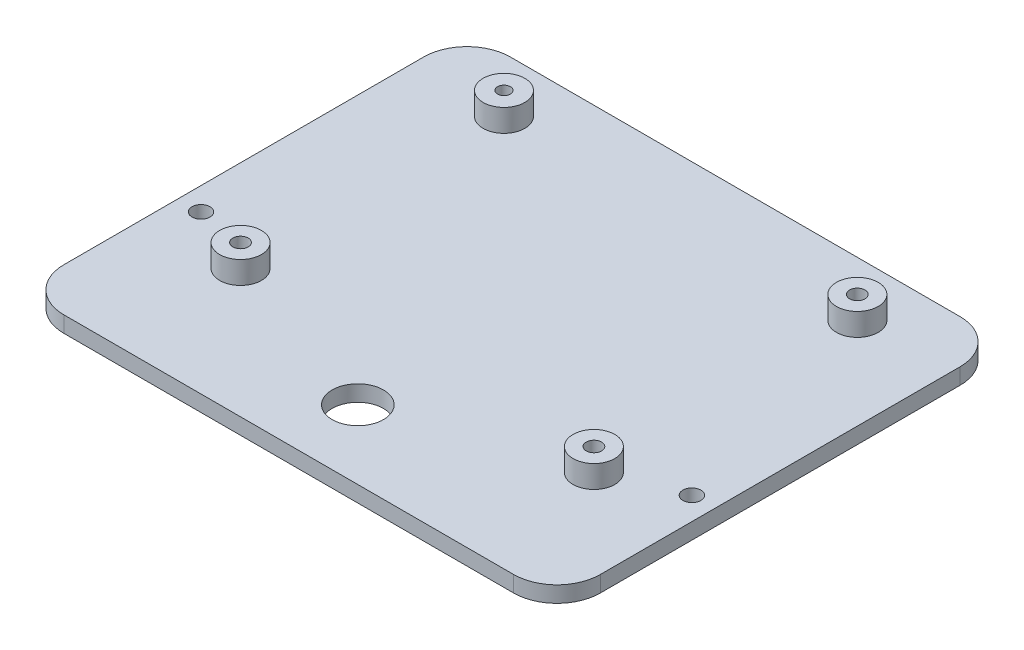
ISO-10303-21;
HEADER;
FILE_DESCRIPTION(('STEP AP214'),'2;1');
FILE_NAME('part.step','',(''),(''),'','','');
FILE_SCHEMA(('AUTOMOTIVE_DESIGN { 1 0 10303 214 1 1 1 1 }'));
ENDSEC;
DATA;
#1=APPLICATION_CONTEXT('core data for automotive mechanical design processes');
#2=APPLICATION_PROTOCOL_DEFINITION('international standard','automotive_design',2000,#1);
#3=PRODUCT_CONTEXT('',#1,'mechanical');
#4=PRODUCT('Part','Part','',(#3));
#5=PRODUCT_RELATED_PRODUCT_CATEGORY('part','',(#4));
#6=PRODUCT_DEFINITION_FORMATION('','',#4);
#7=PRODUCT_DEFINITION_CONTEXT('part definition',#1,'design');
#8=PRODUCT_DEFINITION('design','',#6,#7);
#9=PRODUCT_DEFINITION_SHAPE('','',#8);
#10=(LENGTH_UNIT() NAMED_UNIT(*) SI_UNIT(.MILLI.,.METRE.));
#11=(NAMED_UNIT(*) PLANE_ANGLE_UNIT() SI_UNIT($,.RADIAN.));
#12=(NAMED_UNIT(*) SI_UNIT($,.STERADIAN.) SOLID_ANGLE_UNIT());
#13=UNCERTAINTY_MEASURE_WITH_UNIT(LENGTH_MEASURE(1.E-05),#10,'distance_accuracy_value','');
#14=(GEOMETRIC_REPRESENTATION_CONTEXT(3) GLOBAL_UNCERTAINTY_ASSIGNED_CONTEXT((#13)) GLOBAL_UNIT_ASSIGNED_CONTEXT((#10,
#11,#12)) REPRESENTATION_CONTEXT('',''));
#15=CARTESIAN_POINT('',(0.,0.,0.));
#16=DIRECTION('',(0.,0.,1.));
#17=DIRECTION('',(1.,0.,0.));
#18=AXIS2_PLACEMENT_3D('',#15,#16,#17);
#19=CARTESIAN_POINT('',(0.,-33.,0.));
#20=DIRECTION('',(0.,-1.,0.));
#21=DIRECTION('',(0.,0.,-1.));
#22=AXIS2_PLACEMENT_3D('',#19,#20,#21);
#23=PLANE('',#22);
#24=CARTESIAN_POINT('',(27.5,-33.,26.05));
#25=DIRECTION('',(0.,-1.,0.));
#26=DIRECTION('',(0.,0.,-1.));
#27=AXIS2_PLACEMENT_3D('',#24,#25,#26);
#28=CIRCLE('',#27,3.25);
#29=CARTESIAN_POINT('',(27.5,-33.,22.8));
#30=VERTEX_POINT('',#29);
#31=EDGE_CURVE('E50',#30,#30,#28,.F.);
#32=ORIENTED_EDGE('',*,*,#31,.F.);
#33=EDGE_LOOP('',(#32));
#34=FACE_BOUND('',#33,.T.);
#35=CARTESIAN_POINT('',(-27.5,-33.,-14.95));
#36=DIRECTION('',(0.,-1.,0.));
#37=DIRECTION('',(0.,0.,-1.));
#38=AXIS2_PLACEMENT_3D('',#35,#36,#37);
#39=CIRCLE('',#38,3.25);
#40=CARTESIAN_POINT('',(-27.5,-33.,-18.2));
#41=VERTEX_POINT('',#40);
#42=EDGE_CURVE('E211',#41,#41,#39,.F.);
#43=ORIENTED_EDGE('',*,*,#42,.F.);
#44=EDGE_LOOP('',(#43));
#45=FACE_BOUND('',#44,.T.);
#46=CARTESIAN_POINT('',(0.,-33.,35.3));
#47=DIRECTION('',(0.,1.,0.));
#48=DIRECTION('',(0.,0.,1.));
#49=AXIS2_PLACEMENT_3D('',#46,#47,#48);
#50=CIRCLE('',#49,4.);
#51=CARTESIAN_POINT('',(0.,-33.,39.3));
#52=VERTEX_POINT('',#51);
#53=EDGE_CURVE('E271',#52,#52,#50,.T.);
#54=ORIENTED_EDGE('',*,*,#53,.F.);
#55=EDGE_LOOP('',(#54));
#56=FACE_BOUND('',#55,.T.);
#57=CARTESIAN_POINT('',(-38.1999999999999,-33.,21.5));
#58=DIRECTION('',(0.,-1.,0.));
#59=DIRECTION('',(0.,0.,-1.));
#60=AXIS2_PLACEMENT_3D('',#57,#58,#59);
#61=CIRCLE('',#60,1.4);
#62=CARTESIAN_POINT('',(-38.1999999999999,-33.,20.1));
#63=VERTEX_POINT('',#62);
#64=EDGE_CURVE('E178',#63,#63,#61,.T.);
#65=ORIENTED_EDGE('',*,*,#64,.T.);
#66=EDGE_LOOP('',(#65));
#67=FACE_BOUND('',#66,.T.);
#68=CARTESIAN_POINT('',(38.2,-33.,21.5));
#69=DIRECTION('',(0.,-1.,0.));
#70=DIRECTION('',(0.,0.,-1.));
#71=AXIS2_PLACEMENT_3D('',#68,#69,#70);
#72=CIRCLE('',#71,1.4);
#73=CARTESIAN_POINT('',(38.2,-33.,20.1));
#74=VERTEX_POINT('',#73);
#75=EDGE_CURVE('E154',#74,#74,#72,.T.);
#76=ORIENTED_EDGE('',*,*,#75,.T.);
#77=EDGE_LOOP('',(#76));
#78=FACE_BOUND('',#77,.T.);
#79=CARTESIAN_POINT('',(-34.9999999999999,-33.,39.3));
#80=DIRECTION('',(0.,-1.,0.));
#81=DIRECTION('',(0.,0.,-1.));
#82=AXIS2_PLACEMENT_3D('',#79,#80,#81);
#83=CIRCLE('',#82,6.75000000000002);
#84=CARTESIAN_POINT('',(-34.9999999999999,-33.,46.0499999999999));
#85=VERTEX_POINT('',#84);
#86=CARTESIAN_POINT('',(-41.7499999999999,-33.,39.3));
#87=VERTEX_POINT('',#86);
#88=EDGE_CURVE('E208',#85,#87,#83,.T.);
#89=ORIENTED_EDGE('',*,*,#88,.F.);
#90=DIRECTION('',(-1.,0.,0.));
#91=VECTOR('',#90,1.);
#92=CARTESIAN_POINT('',(0.,-33.,46.0499999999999));
#93=LINE('',#92,#91);
#94=CARTESIAN_POINT('',(35.,-33.,46.0499999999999));
#95=VERTEX_POINT('',#94);
#96=EDGE_CURVE('E183',#95,#85,#93,.T.);
#97=ORIENTED_EDGE('',*,*,#96,.F.);
#98=CARTESIAN_POINT('',(35.,-33.,39.3));
#99=DIRECTION('',(0.,-1.,0.));
#100=DIRECTION('',(0.,0.,-1.));
#101=AXIS2_PLACEMENT_3D('',#98,#99,#100);
#102=CIRCLE('',#101,6.74999999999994);
#103=CARTESIAN_POINT('',(41.7499999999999,-33.,39.3));
#104=VERTEX_POINT('',#103);
#105=EDGE_CURVE('E114',#104,#95,#102,.T.);
#106=ORIENTED_EDGE('',*,*,#105,.F.);
#107=DIRECTION('',(0.,0.,-1.));
#108=VECTOR('',#107,1.);
#109=CARTESIAN_POINT('',(41.7499999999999,-33.,0.));
#110=LINE('',#109,#108);
#111=CARTESIAN_POINT('',(41.7499999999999,-33.,-16.7));
#112=VERTEX_POINT('',#111);
#113=EDGE_CURVE('E191',#104,#112,#110,.T.);
#114=ORIENTED_EDGE('',*,*,#113,.T.);
#115=CARTESIAN_POINT('',(35.,-33.,-16.7));
#116=DIRECTION('',(0.,-1.,0.));
#117=DIRECTION('',(0.,0.,-1.));
#118=AXIS2_PLACEMENT_3D('',#115,#116,#117);
#119=CIRCLE('',#118,6.74999999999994);
#120=CARTESIAN_POINT('',(35.,-33.,-23.4499999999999));
#121=VERTEX_POINT('',#120);
#122=EDGE_CURVE('E195',#121,#112,#119,.T.);
#123=ORIENTED_EDGE('',*,*,#122,.F.);
#124=DIRECTION('',(-1.,0.,0.));
#125=VECTOR('',#124,1.);
#126=CARTESIAN_POINT('',(0.,-33.,-23.4499999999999));
#127=LINE('',#126,#125);
#128=CARTESIAN_POINT('',(-34.9999999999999,-33.,-23.4499999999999));
#129=VERTEX_POINT('',#128);
#130=EDGE_CURVE('E198',#121,#129,#127,.T.);
#131=ORIENTED_EDGE('',*,*,#130,.T.);
#132=CARTESIAN_POINT('',(-34.9999999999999,-33.,-16.7));
#133=DIRECTION('',(0.,-1.,0.));
#134=DIRECTION('',(0.,0.,-1.));
#135=AXIS2_PLACEMENT_3D('',#132,#133,#134);
#136=CIRCLE('',#135,6.74999999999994);
#137=CARTESIAN_POINT('',(-41.7499999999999,-33.,-16.7));
#138=VERTEX_POINT('',#137);
#139=EDGE_CURVE('E202',#138,#129,#136,.T.);
#140=ORIENTED_EDGE('',*,*,#139,.F.);
#141=DIRECTION('',(0.,0.,-1.));
#142=VECTOR('',#141,1.);
#143=CARTESIAN_POINT('',(-41.7499999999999,-33.,0.));
#144=LINE('',#143,#142);
#145=EDGE_CURVE('E205',#87,#138,#144,.T.);
#146=ORIENTED_EDGE('',*,*,#145,.F.);
#147=EDGE_LOOP('',(#89,#97,#106,#114,#123,#131,#140,#146));
#148=FACE_BOUND('',#147,.T.);
#149=CARTESIAN_POINT('',(27.5,-33.,-14.95));
#150=DIRECTION('',(0.,-1.,0.));
#151=DIRECTION('',(0.,0.,-1.));
#152=AXIS2_PLACEMENT_3D('',#149,#150,#151);
#153=CIRCLE('',#152,3.25);
#154=CARTESIAN_POINT('',(27.5,-33.,-18.2));
#155=VERTEX_POINT('',#154);
#156=EDGE_CURVE('E215',#155,#155,#153,.F.);
#157=ORIENTED_EDGE('',*,*,#156,.F.);
#158=EDGE_LOOP('',(#157));
#159=FACE_BOUND('',#158,.T.);
#160=CARTESIAN_POINT('',(-27.5,-33.,26.05));
#161=DIRECTION('',(0.,-1.,0.));
#162=DIRECTION('',(0.,0.,-1.));
#163=AXIS2_PLACEMENT_3D('',#160,#161,#162);
#164=CIRCLE('',#163,3.25);
#165=CARTESIAN_POINT('',(-27.5,-33.,22.8));
#166=VERTEX_POINT('',#165);
#167=EDGE_CURVE('E11',#166,#166,#164,.F.);
#168=ORIENTED_EDGE('',*,*,#167,.F.);
#169=EDGE_LOOP('',(#168));
#170=FACE_BOUND('',#169,.T.);
#171=ADVANCED_FACE('F41',(#34,#45,#56,#67,#78,#148,#159,#170),#23,.F.);
#172=CARTESIAN_POINT('',(0.,-35.5,0.));
#173=DIRECTION('',(0.,-1.,0.));
#174=DIRECTION('',(0.,0.,-1.));
#175=AXIS2_PLACEMENT_3D('',#172,#173,#174);
#176=PLANE('',#175);
#177=CARTESIAN_POINT('',(0.,-35.5,35.3));
#178=DIRECTION('',(0.,-1.,0.));
#179=DIRECTION('',(0.,0.,-1.));
#180=AXIS2_PLACEMENT_3D('',#177,#178,#179);
#181=CIRCLE('',#180,4.);
#182=CARTESIAN_POINT('',(0.,-35.5,31.3));
#183=VERTEX_POINT('',#182);
#184=EDGE_CURVE('E275',#183,#183,#181,.T.);
#185=ORIENTED_EDGE('',*,*,#184,.F.);
#186=EDGE_LOOP('',(#185));
#187=FACE_BOUND('',#186,.T.);
#188=CARTESIAN_POINT('',(-38.1999999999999,-35.5,21.5));
#189=DIRECTION('',(0.,-1.,0.));
#190=DIRECTION('',(0.,0.,-1.));
#191=AXIS2_PLACEMENT_3D('',#188,#189,#190);
#192=CIRCLE('',#191,1.4);
#193=CARTESIAN_POINT('',(-38.1999999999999,-35.5,20.1));
#194=VERTEX_POINT('',#193);
#195=EDGE_CURVE('E179',#194,#194,#192,.T.);
#196=ORIENTED_EDGE('',*,*,#195,.F.);
#197=EDGE_LOOP('',(#196));
#198=FACE_BOUND('',#197,.T.);
#199=CARTESIAN_POINT('',(38.2,-35.5,21.5));
#200=DIRECTION('',(0.,-1.,0.));
#201=DIRECTION('',(0.,0.,-1.));
#202=AXIS2_PLACEMENT_3D('',#199,#200,#201);
#203=CIRCLE('',#202,1.4);
#204=CARTESIAN_POINT('',(38.2,-35.5,20.1));
#205=VERTEX_POINT('',#204);
#206=EDGE_CURVE('E174',#205,#205,#203,.T.);
#207=ORIENTED_EDGE('',*,*,#206,.F.);
#208=EDGE_LOOP('',(#207));
#209=FACE_BOUND('',#208,.T.);
#210=DIRECTION('',(-1.,0.,0.));
#211=VECTOR('',#210,1.);
#212=CARTESIAN_POINT('',(0.,-35.5,46.0499999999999));
#213=LINE('',#212,#211);
#214=CARTESIAN_POINT('',(35.,-35.5,46.0499999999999));
#215=VERTEX_POINT('',#214);
#216=CARTESIAN_POINT('',(-34.9999999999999,-35.5,46.0499999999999));
#217=VERTEX_POINT('',#216);
#218=EDGE_CURVE('E121',#215,#217,#213,.T.);
#219=ORIENTED_EDGE('',*,*,#218,.T.);
#220=CARTESIAN_POINT('',(-34.9999999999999,-35.5,39.3));
#221=DIRECTION('',(0.,-1.,0.));
#222=DIRECTION('',(0.,0.,-1.));
#223=AXIS2_PLACEMENT_3D('',#220,#221,#222);
#224=CIRCLE('',#223,6.75000000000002);
#225=CARTESIAN_POINT('',(-41.7499999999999,-35.5,39.3));
#226=VERTEX_POINT('',#225);
#227=EDGE_CURVE('E58',#217,#226,#224,.T.);
#228=ORIENTED_EDGE('',*,*,#227,.T.);
#229=DIRECTION('',(0.,0.,-1.));
#230=VECTOR('',#229,1.);
#231=CARTESIAN_POINT('',(-41.7499999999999,-35.5,0.));
#232=LINE('',#231,#230);
#233=CARTESIAN_POINT('',(-41.7499999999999,-35.5,-16.7));
#234=VERTEX_POINT('',#233);
#235=EDGE_CURVE('E147',#226,#234,#232,.T.);
#236=ORIENTED_EDGE('',*,*,#235,.T.);
#237=CARTESIAN_POINT('',(-34.9999999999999,-35.5,-16.7));
#238=DIRECTION('',(0.,-1.,0.));
#239=DIRECTION('',(0.,0.,-1.));
#240=AXIS2_PLACEMENT_3D('',#237,#238,#239);
#241=CIRCLE('',#240,6.74999999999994);
#242=CARTESIAN_POINT('',(-34.9999999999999,-35.5,-23.4499999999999));
#243=VERTEX_POINT('',#242);
#244=EDGE_CURVE('E143',#234,#243,#241,.T.);
#245=ORIENTED_EDGE('',*,*,#244,.T.);
#246=DIRECTION('',(-1.,0.,0.));
#247=VECTOR('',#246,1.);
#248=CARTESIAN_POINT('',(0.,-35.5,-23.4499999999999));
#249=LINE('',#248,#247);
#250=CARTESIAN_POINT('',(35.,-35.5,-23.4499999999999));
#251=VERTEX_POINT('',#250);
#252=EDGE_CURVE('E139',#251,#243,#249,.T.);
#253=ORIENTED_EDGE('',*,*,#252,.F.);
#254=CARTESIAN_POINT('',(35.,-35.5,-16.7));
#255=DIRECTION('',(0.,-1.,0.));
#256=DIRECTION('',(0.,0.,-1.));
#257=AXIS2_PLACEMENT_3D('',#254,#255,#256);
#258=CIRCLE('',#257,6.74999999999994);
#259=CARTESIAN_POINT('',(41.7499999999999,-35.5,-16.7));
#260=VERTEX_POINT('',#259);
#261=EDGE_CURVE('E133',#251,#260,#258,.T.);
#262=ORIENTED_EDGE('',*,*,#261,.T.);
#263=DIRECTION('',(0.,0.,-1.));
#264=VECTOR('',#263,1.);
#265=CARTESIAN_POINT('',(41.7499999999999,-35.5,0.));
#266=LINE('',#265,#264);
#267=CARTESIAN_POINT('',(41.7499999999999,-35.5,39.3));
#268=VERTEX_POINT('',#267);
#269=EDGE_CURVE('E129',#268,#260,#266,.T.);
#270=ORIENTED_EDGE('',*,*,#269,.F.);
#271=CARTESIAN_POINT('',(35.,-35.5,39.3));
#272=DIRECTION('',(0.,-1.,0.));
#273=DIRECTION('',(0.,0.,-1.));
#274=AXIS2_PLACEMENT_3D('',#271,#272,#273);
#275=CIRCLE('',#274,6.74999999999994);
#276=EDGE_CURVE('E111',#268,#215,#275,.T.);
#277=ORIENTED_EDGE('',*,*,#276,.T.);
#278=EDGE_LOOP('',(#219,#228,#236,#245,#253,#262,#270,#277));
#279=FACE_BOUND('',#278,.T.);
#280=ADVANCED_FACE('F126',(#187,#198,#209,#279),#176,.T.);
#281=CARTESIAN_POINT('',(-38.1999999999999,-27.,21.5));
#282=DIRECTION('',(0.,-1.,0.));
#283=DIRECTION('',(0.,0.,-1.));
#284=AXIS2_PLACEMENT_3D('',#281,#282,#283);
#285=CYLINDRICAL_SURFACE('',#284,1.4);
#286=ORIENTED_EDGE('',*,*,#195,.T.);
#287=EDGE_LOOP('',(#286));
#288=FACE_BOUND('',#287,.T.);
#289=ORIENTED_EDGE('',*,*,#64,.F.);
#290=EDGE_LOOP('',(#289));
#291=FACE_BOUND('',#290,.T.);
#292=ADVANCED_FACE('F313',(#288,#291),#285,.F.);
#293=CARTESIAN_POINT('',(38.2,-27.,21.5));
#294=DIRECTION('',(0.,-1.,0.));
#295=DIRECTION('',(0.,0.,-1.));
#296=AXIS2_PLACEMENT_3D('',#293,#294,#295);
#297=CYLINDRICAL_SURFACE('',#296,1.4);
#298=ORIENTED_EDGE('',*,*,#206,.T.);
#299=EDGE_LOOP('',(#298));
#300=FACE_BOUND('',#299,.T.);
#301=ORIENTED_EDGE('',*,*,#75,.F.);
#302=EDGE_LOOP('',(#301));
#303=FACE_BOUND('',#302,.T.);
#304=ADVANCED_FACE('F306',(#300,#303),#297,.F.);
#305=CARTESIAN_POINT('',(-34.9999999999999,-0.5,39.3));
#306=DIRECTION('',(0.,-1.,0.));
#307=DIRECTION('',(0.,0.,-1.));
#308=AXIS2_PLACEMENT_3D('',#305,#306,#307);
#309=CYLINDRICAL_SURFACE('',#308,6.75000000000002);
#310=ORIENTED_EDGE('',*,*,#88,.T.);
#311=DIRECTION('',(0.,-1.,0.));
#312=VECTOR('',#311,1.);
#313=CARTESIAN_POINT('',(-41.7499999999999,-0.5,39.3));
#314=LINE('',#313,#312);
#315=EDGE_CURVE('E151',#87,#226,#314,.T.);
#316=ORIENTED_EDGE('',*,*,#315,.T.);
#317=ORIENTED_EDGE('',*,*,#227,.F.);
#318=DIRECTION('',(0.,-1.,0.));
#319=VECTOR('',#318,1.);
#320=CARTESIAN_POINT('',(-34.9999999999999,-0.5,46.0499999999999));
#321=LINE('',#320,#319);
#322=EDGE_CURVE('E118',#85,#217,#321,.T.);
#323=ORIENTED_EDGE('',*,*,#322,.F.);
#324=EDGE_LOOP('',(#310,#316,#317,#323));
#325=FACE_BOUND('',#324,.T.);
#326=ADVANCED_FACE('F304',(#325),#309,.T.);
#327=CARTESIAN_POINT('',(-41.7499999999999,-0.5,0.));
#328=DIRECTION('',(-1.,0.,0.));
#329=DIRECTION('',(0.,0.,1.));
#330=AXIS2_PLACEMENT_3D('',#327,#328,#329);
#331=PLANE('',#330);
#332=ORIENTED_EDGE('',*,*,#145,.T.);
#333=DIRECTION('',(0.,-1.,0.));
#334=VECTOR('',#333,1.);
#335=CARTESIAN_POINT('',(-41.7499999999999,-0.5,-16.7));
#336=LINE('',#335,#334);
#337=EDGE_CURVE('E155',#138,#234,#336,.T.);
#338=ORIENTED_EDGE('',*,*,#337,.T.);
#339=ORIENTED_EDGE('',*,*,#235,.F.);
#340=ORIENTED_EDGE('',*,*,#315,.F.);
#341=EDGE_LOOP('',(#332,#338,#339,#340));
#342=FACE_BOUND('',#341,.T.);
#343=ADVANCED_FACE('F284',(#342),#331,.T.);
#344=CARTESIAN_POINT('',(-34.9999999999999,-0.5,-16.7));
#345=DIRECTION('',(0.,-1.,0.));
#346=DIRECTION('',(0.,0.,-1.));
#347=AXIS2_PLACEMENT_3D('',#344,#345,#346);
#348=CYLINDRICAL_SURFACE('',#347,6.74999999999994);
#349=ORIENTED_EDGE('',*,*,#139,.T.);
#350=DIRECTION('',(0.,-1.,0.));
#351=VECTOR('',#350,1.);
#352=CARTESIAN_POINT('',(-34.9999999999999,-0.5,-23.4499999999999));
#353=LINE('',#352,#351);
#354=EDGE_CURVE('E158',#129,#243,#353,.T.);
#355=ORIENTED_EDGE('',*,*,#354,.T.);
#356=ORIENTED_EDGE('',*,*,#244,.F.);
#357=ORIENTED_EDGE('',*,*,#337,.F.);
#358=EDGE_LOOP('',(#349,#355,#356,#357));
#359=FACE_BOUND('',#358,.T.);
#360=ADVANCED_FACE('F289',(#359),#348,.T.);
#361=CARTESIAN_POINT('',(0.,-0.5,-23.4499999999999));
#362=DIRECTION('',(0.,0.,1.));
#363=DIRECTION('',(1.,0.,0.));
#364=AXIS2_PLACEMENT_3D('',#361,#362,#363);
#365=PLANE('',#364);
#366=DIRECTION('',(0.,-1.,0.));
#367=VECTOR('',#366,1.);
#368=CARTESIAN_POINT('',(35.,-0.5,-23.4499999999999));
#369=LINE('',#368,#367);
#370=EDGE_CURVE('E161',#121,#251,#369,.T.);
#371=ORIENTED_EDGE('',*,*,#370,.T.);
#372=ORIENTED_EDGE('',*,*,#252,.T.);
#373=ORIENTED_EDGE('',*,*,#354,.F.);
#374=ORIENTED_EDGE('',*,*,#130,.F.);
#375=EDGE_LOOP('',(#371,#372,#373,#374));
#376=FACE_BOUND('',#375,.T.);
#377=ADVANCED_FACE('F292',(#376),#365,.F.);
#378=CARTESIAN_POINT('',(35.,-0.5,-16.7));
#379=DIRECTION('',(0.,-1.,0.));
#380=DIRECTION('',(0.,0.,-1.));
#381=AXIS2_PLACEMENT_3D('',#378,#379,#380);
#382=CYLINDRICAL_SURFACE('',#381,6.74999999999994);
#383=ORIENTED_EDGE('',*,*,#122,.T.);
#384=DIRECTION('',(0.,-1.,0.));
#385=VECTOR('',#384,1.);
#386=CARTESIAN_POINT('',(41.7499999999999,-0.5,-16.7));
#387=LINE('',#386,#385);
#388=EDGE_CURVE('E164',#112,#260,#387,.T.);
#389=ORIENTED_EDGE('',*,*,#388,.T.);
#390=ORIENTED_EDGE('',*,*,#261,.F.);
#391=ORIENTED_EDGE('',*,*,#370,.F.);
#392=EDGE_LOOP('',(#383,#389,#390,#391));
#393=FACE_BOUND('',#392,.T.);
#394=ADVANCED_FACE('F296',(#393),#382,.T.);
#395=CARTESIAN_POINT('',(41.7499999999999,-0.5,0.));
#396=DIRECTION('',(-1.,0.,0.));
#397=DIRECTION('',(0.,0.,1.));
#398=AXIS2_PLACEMENT_3D('',#395,#396,#397);
#399=PLANE('',#398);
#400=DIRECTION('',(0.,-1.,0.));
#401=VECTOR('',#400,1.);
#402=CARTESIAN_POINT('',(41.7499999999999,-0.5,39.3));
#403=LINE('',#402,#401);
#404=EDGE_CURVE('E117',#104,#268,#403,.T.);
#405=ORIENTED_EDGE('',*,*,#404,.T.);
#406=ORIENTED_EDGE('',*,*,#269,.T.);
#407=ORIENTED_EDGE('',*,*,#388,.F.);
#408=ORIENTED_EDGE('',*,*,#113,.F.);
#409=EDGE_LOOP('',(#405,#406,#407,#408));
#410=FACE_BOUND('',#409,.T.);
#411=ADVANCED_FACE('F300',(#410),#399,.F.);
#412=CARTESIAN_POINT('',(35.,-0.5,39.3));
#413=DIRECTION('',(0.,-1.,0.));
#414=DIRECTION('',(0.,0.,-1.));
#415=AXIS2_PLACEMENT_3D('',#412,#413,#414);
#416=CYLINDRICAL_SURFACE('',#415,6.74999999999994);
#417=ORIENTED_EDGE('',*,*,#105,.T.);
#418=DIRECTION('',(0.,-1.,0.));
#419=VECTOR('',#418,1.);
#420=CARTESIAN_POINT('',(35.,-0.5,46.0499999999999));
#421=LINE('',#420,#419);
#422=EDGE_CURVE('E66',#95,#215,#421,.T.);
#423=ORIENTED_EDGE('',*,*,#422,.T.);
#424=ORIENTED_EDGE('',*,*,#276,.F.);
#425=ORIENTED_EDGE('',*,*,#404,.F.);
#426=EDGE_LOOP('',(#417,#423,#424,#425));
#427=FACE_BOUND('',#426,.T.);
#428=ADVANCED_FACE('F108',(#427),#416,.T.);
#429=CARTESIAN_POINT('',(0.,-0.5,46.0499999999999));
#430=DIRECTION('',(0.,0.,1.));
#431=DIRECTION('',(1.,0.,0.));
#432=AXIS2_PLACEMENT_3D('',#429,#430,#431);
#433=PLANE('',#432);
#434=ORIENTED_EDGE('',*,*,#96,.T.);
#435=ORIENTED_EDGE('',*,*,#322,.T.);
#436=ORIENTED_EDGE('',*,*,#218,.F.);
#437=ORIENTED_EDGE('',*,*,#422,.F.);
#438=EDGE_LOOP('',(#434,#435,#436,#437));
#439=FACE_BOUND('',#438,.T.);
#440=ADVANCED_FACE('F122',(#439),#433,.T.);
#441=CARTESIAN_POINT('',(-27.5,-43.,-14.95));
#442=DIRECTION('',(0.,1.,0.));
#443=DIRECTION('',(0.,0.,1.));
#444=AXIS2_PLACEMENT_3D('',#441,#442,#443);
#445=CYLINDRICAL_SURFACE('',#444,0.999999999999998);
#446=CARTESIAN_POINT('',(-27.5,-34.5,-14.95));
#447=DIRECTION('',(0.,1.,0.));
#448=DIRECTION('',(0.,0.,1.));
#449=AXIS2_PLACEMENT_3D('',#446,#447,#448);
#450=CIRCLE('',#449,0.999999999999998);
#451=CARTESIAN_POINT('',(-27.5,-34.5,-13.95));
#452=VERTEX_POINT('',#451);
#453=EDGE_CURVE('E225',#452,#452,#450,.F.);
#454=ORIENTED_EDGE('',*,*,#453,.T.);
#455=EDGE_LOOP('',(#454));
#456=FACE_BOUND('',#455,.T.);
#457=CARTESIAN_POINT('',(-27.5,-29.5,-14.95));
#458=DIRECTION('',(0.,1.,0.));
#459=DIRECTION('',(0.,0.,1.));
#460=AXIS2_PLACEMENT_3D('',#457,#458,#459);
#461=CIRCLE('',#460,0.999999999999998);
#462=CARTESIAN_POINT('',(-27.5,-29.5,-13.95));
#463=VERTEX_POINT('',#462);
#464=EDGE_CURVE('E263',#463,#463,#461,.T.);
#465=ORIENTED_EDGE('',*,*,#464,.T.);
#466=EDGE_LOOP('',(#465));
#467=FACE_BOUND('',#466,.T.);
#468=ADVANCED_FACE('F409',(#456,#467),#445,.F.);
#469=CARTESIAN_POINT('',(27.5,-43.,26.05));
#470=DIRECTION('',(0.,1.,0.));
#471=DIRECTION('',(0.,0.,1.));
#472=AXIS2_PLACEMENT_3D('',#469,#470,#471);
#473=CYLINDRICAL_SURFACE('',#472,1.2);
#474=CARTESIAN_POINT('',(27.5,-34.5,26.05));
#475=DIRECTION('',(0.,1.,0.));
#476=DIRECTION('',(0.,0.,1.));
#477=AXIS2_PLACEMENT_3D('',#474,#475,#476);
#478=CIRCLE('',#477,1.2);
#479=CARTESIAN_POINT('',(27.5,-34.5,27.25));
#480=VERTEX_POINT('',#479);
#481=EDGE_CURVE('E224',#480,#480,#478,.F.);
#482=ORIENTED_EDGE('',*,*,#481,.T.);
#483=EDGE_LOOP('',(#482));
#484=FACE_BOUND('',#483,.T.);
#485=CARTESIAN_POINT('',(27.5,-29.5,26.05));
#486=DIRECTION('',(0.,1.,0.));
#487=DIRECTION('',(0.,0.,1.));
#488=AXIS2_PLACEMENT_3D('',#485,#486,#487);
#489=CIRCLE('',#488,1.2);
#490=CARTESIAN_POINT('',(27.5,-29.5,27.25));
#491=VERTEX_POINT('',#490);
#492=EDGE_CURVE('E247',#491,#491,#489,.T.);
#493=ORIENTED_EDGE('',*,*,#492,.T.);
#494=EDGE_LOOP('',(#493));
#495=FACE_BOUND('',#494,.T.);
#496=ADVANCED_FACE('F545',(#484,#495),#473,.F.);
#497=CARTESIAN_POINT('',(-27.5,-43.,26.05));
#498=DIRECTION('',(0.,1.,0.));
#499=DIRECTION('',(0.,0.,1.));
#500=AXIS2_PLACEMENT_3D('',#497,#498,#499);
#501=CYLINDRICAL_SURFACE('',#500,1.2);
#502=CARTESIAN_POINT('',(-27.5,-34.5,26.05));
#503=DIRECTION('',(0.,1.,0.));
#504=DIRECTION('',(0.,0.,1.));
#505=AXIS2_PLACEMENT_3D('',#502,#503,#504);
#506=CIRCLE('',#505,1.2);
#507=CARTESIAN_POINT('',(-27.5,-34.5,27.25));
#508=VERTEX_POINT('',#507);
#509=EDGE_CURVE('E44',#508,#508,#506,.F.);
#510=ORIENTED_EDGE('',*,*,#509,.T.);
#511=EDGE_LOOP('',(#510));
#512=FACE_BOUND('',#511,.T.);
#513=CARTESIAN_POINT('',(-27.5,-29.5,26.05));
#514=DIRECTION('',(0.,1.,0.));
#515=DIRECTION('',(0.,0.,1.));
#516=AXIS2_PLACEMENT_3D('',#513,#514,#515);
#517=CIRCLE('',#516,1.2);
#518=CARTESIAN_POINT('',(-27.5,-29.5,27.25));
#519=VERTEX_POINT('',#518);
#520=EDGE_CURVE('E231',#519,#519,#517,.T.);
#521=ORIENTED_EDGE('',*,*,#520,.T.);
#522=EDGE_LOOP('',(#521));
#523=FACE_BOUND('',#522,.T.);
#524=ADVANCED_FACE('F555',(#512,#523),#501,.F.);
#525=CARTESIAN_POINT('',(27.5,-43.,-14.95));
#526=DIRECTION('',(0.,1.,0.));
#527=DIRECTION('',(0.,0.,1.));
#528=AXIS2_PLACEMENT_3D('',#525,#526,#527);
#529=CYLINDRICAL_SURFACE('',#528,1.2);
#530=CARTESIAN_POINT('',(27.5,-34.5,-14.95));
#531=DIRECTION('',(0.,1.,0.));
#532=DIRECTION('',(0.,0.,1.));
#533=AXIS2_PLACEMENT_3D('',#530,#531,#532);
#534=CIRCLE('',#533,1.2);
#535=CARTESIAN_POINT('',(27.5,-34.5,-13.75));
#536=VERTEX_POINT('',#535);
#537=EDGE_CURVE('E221',#536,#536,#534,.F.);
#538=ORIENTED_EDGE('',*,*,#537,.T.);
#539=EDGE_LOOP('',(#538));
#540=FACE_BOUND('',#539,.T.);
#541=CARTESIAN_POINT('',(27.5,-29.5,-14.95));
#542=DIRECTION('',(0.,1.,0.));
#543=DIRECTION('',(0.,0.,1.));
#544=AXIS2_PLACEMENT_3D('',#541,#542,#543);
#545=CIRCLE('',#544,1.2);
#546=CARTESIAN_POINT('',(27.5,-29.5,-13.75));
#547=VERTEX_POINT('',#546);
#548=EDGE_CURVE('E255',#547,#547,#545,.T.);
#549=ORIENTED_EDGE('',*,*,#548,.T.);
#550=EDGE_LOOP('',(#549));
#551=FACE_BOUND('',#550,.T.);
#552=ADVANCED_FACE('F419',(#540,#551),#529,.F.);
#553=CARTESIAN_POINT('',(0.,-43.,35.3));
#554=DIRECTION('',(0.,1.,0.));
#555=DIRECTION('',(0.,0.,1.));
#556=AXIS2_PLACEMENT_3D('',#553,#554,#555);
#557=CYLINDRICAL_SURFACE('',#556,4.);
#558=ORIENTED_EDGE('',*,*,#184,.T.);
#559=EDGE_LOOP('',(#558));
#560=FACE_BOUND('',#559,.T.);
#561=ORIENTED_EDGE('',*,*,#53,.T.);
#562=EDGE_LOOP('',(#561));
#563=FACE_BOUND('',#562,.T.);
#564=ADVANCED_FACE('F414',(#560,#563),#557,.F.);
#565=CARTESIAN_POINT('',(-27.5,-29.5,-14.95));
#566=DIRECTION('',(0.,1.,0.));
#567=DIRECTION('',(0.,0.,1.));
#568=AXIS2_PLACEMENT_3D('',#565,#566,#567);
#569=PLANE('',#568);
#570=CARTESIAN_POINT('',(-27.5,-29.5,-14.95));
#571=DIRECTION('',(0.,1.,0.));
#572=DIRECTION('',(0.,0.,1.));
#573=AXIS2_PLACEMENT_3D('',#570,#571,#572);
#574=CIRCLE('',#573,3.25);
#575=CARTESIAN_POINT('',(-27.5,-29.5,-11.7));
#576=VERTEX_POINT('',#575);
#577=EDGE_CURVE('E267',#576,#576,#574,.T.);
#578=ORIENTED_EDGE('',*,*,#577,.T.);
#579=EDGE_LOOP('',(#578));
#580=FACE_BOUND('',#579,.T.);
#581=ORIENTED_EDGE('',*,*,#464,.F.);
#582=EDGE_LOOP('',(#581));
#583=FACE_BOUND('',#582,.T.);
#584=ADVANCED_FACE('F418',(#580,#583),#569,.T.);
#585=CARTESIAN_POINT('',(-27.5,-29.5,-14.95));
#586=DIRECTION('',(0.,-1.,0.));
#587=DIRECTION('',(0.,0.,-1.));
#588=AXIS2_PLACEMENT_3D('',#585,#586,#587);
#589=CYLINDRICAL_SURFACE('',#588,3.25);
#590=ORIENTED_EDGE('',*,*,#577,.F.);
#591=EDGE_LOOP('',(#590));
#592=FACE_BOUND('',#591,.T.);
#593=ORIENTED_EDGE('',*,*,#42,.T.);
#594=EDGE_LOOP('',(#593));
#595=FACE_BOUND('',#594,.T.);
#596=ADVANCED_FACE('F434',(#592,#595),#589,.T.);
#597=CARTESIAN_POINT('',(27.5,-29.5,-14.95));
#598=DIRECTION('',(0.,1.,0.));
#599=DIRECTION('',(0.,0.,1.));
#600=AXIS2_PLACEMENT_3D('',#597,#598,#599);
#601=PLANE('',#600);
#602=CARTESIAN_POINT('',(27.5,-29.5,-14.95));
#603=DIRECTION('',(0.,1.,0.));
#604=DIRECTION('',(0.,0.,1.));
#605=AXIS2_PLACEMENT_3D('',#602,#603,#604);
#606=CIRCLE('',#605,3.25);
#607=CARTESIAN_POINT('',(27.5,-29.5,-11.7));
#608=VERTEX_POINT('',#607);
#609=EDGE_CURVE('E259',#608,#608,#606,.T.);
#610=ORIENTED_EDGE('',*,*,#609,.T.);
#611=EDGE_LOOP('',(#610));
#612=FACE_BOUND('',#611,.T.);
#613=ORIENTED_EDGE('',*,*,#548,.F.);
#614=EDGE_LOOP('',(#613));
#615=FACE_BOUND('',#614,.T.);
#616=ADVANCED_FACE('F442',(#612,#615),#601,.T.);
#617=CARTESIAN_POINT('',(27.5,-29.5,-14.95));
#618=DIRECTION('',(0.,-1.,0.));
#619=DIRECTION('',(0.,0.,-1.));
#620=AXIS2_PLACEMENT_3D('',#617,#618,#619);
#621=CYLINDRICAL_SURFACE('',#620,3.25);
#622=ORIENTED_EDGE('',*,*,#609,.F.);
#623=EDGE_LOOP('',(#622));
#624=FACE_BOUND('',#623,.T.);
#625=ORIENTED_EDGE('',*,*,#156,.T.);
#626=EDGE_LOOP('',(#625));
#627=FACE_BOUND('',#626,.T.);
#628=ADVANCED_FACE('F450',(#624,#627),#621,.T.);
#629=CARTESIAN_POINT('',(27.5,-29.5,26.05));
#630=DIRECTION('',(0.,1.,0.));
#631=DIRECTION('',(0.,0.,1.));
#632=AXIS2_PLACEMENT_3D('',#629,#630,#631);
#633=PLANE('',#632);
#634=CARTESIAN_POINT('',(27.5,-29.5,26.05));
#635=DIRECTION('',(0.,1.,0.));
#636=DIRECTION('',(0.,0.,1.));
#637=AXIS2_PLACEMENT_3D('',#634,#635,#636);
#638=CIRCLE('',#637,3.25);
#639=CARTESIAN_POINT('',(27.5,-29.5,29.3));
#640=VERTEX_POINT('',#639);
#641=EDGE_CURVE('E251',#640,#640,#638,.T.);
#642=ORIENTED_EDGE('',*,*,#641,.T.);
#643=EDGE_LOOP('',(#642));
#644=FACE_BOUND('',#643,.T.);
#645=ORIENTED_EDGE('',*,*,#492,.F.);
#646=EDGE_LOOP('',(#645));
#647=FACE_BOUND('',#646,.T.);
#648=ADVANCED_FACE('F458',(#644,#647),#633,.T.);
#649=CARTESIAN_POINT('',(27.5,-29.5,26.05));
#650=DIRECTION('',(0.,-1.,0.));
#651=DIRECTION('',(0.,0.,-1.));
#652=AXIS2_PLACEMENT_3D('',#649,#650,#651);
#653=CYLINDRICAL_SURFACE('',#652,3.25);
#654=ORIENTED_EDGE('',*,*,#641,.F.);
#655=EDGE_LOOP('',(#654));
#656=FACE_BOUND('',#655,.T.);
#657=ORIENTED_EDGE('',*,*,#31,.T.);
#658=EDGE_LOOP('',(#657));
#659=FACE_BOUND('',#658,.T.);
#660=ADVANCED_FACE('F466',(#656,#659),#653,.T.);
#661=CARTESIAN_POINT('',(-27.5,-29.5,26.05));
#662=DIRECTION('',(0.,1.,0.));
#663=DIRECTION('',(0.,0.,1.));
#664=AXIS2_PLACEMENT_3D('',#661,#662,#663);
#665=PLANE('',#664);
#666=CARTESIAN_POINT('',(-27.5,-29.5,26.05));
#667=DIRECTION('',(0.,1.,0.));
#668=DIRECTION('',(0.,0.,1.));
#669=AXIS2_PLACEMENT_3D('',#666,#667,#668);
#670=CIRCLE('',#669,3.25);
#671=CARTESIAN_POINT('',(-27.5,-29.5,29.3));
#672=VERTEX_POINT('',#671);
#673=EDGE_CURVE('E243',#672,#672,#670,.T.);
#674=ORIENTED_EDGE('',*,*,#673,.T.);
#675=EDGE_LOOP('',(#674));
#676=FACE_BOUND('',#675,.T.);
#677=ORIENTED_EDGE('',*,*,#520,.F.);
#678=EDGE_LOOP('',(#677));
#679=FACE_BOUND('',#678,.T.);
#680=ADVANCED_FACE('F474',(#676,#679),#665,.T.);
#681=CARTESIAN_POINT('',(-27.5,-29.5,26.05));
#682=DIRECTION('',(0.,-1.,0.));
#683=DIRECTION('',(0.,0.,-1.));
#684=AXIS2_PLACEMENT_3D('',#681,#682,#683);
#685=CYLINDRICAL_SURFACE('',#684,3.25);
#686=ORIENTED_EDGE('',*,*,#673,.F.);
#687=EDGE_LOOP('',(#686));
#688=FACE_BOUND('',#687,.T.);
#689=ORIENTED_EDGE('',*,*,#167,.T.);
#690=EDGE_LOOP('',(#689));
#691=FACE_BOUND('',#690,.T.);
#692=ADVANCED_FACE('F482',(#688,#691),#685,.T.);
#693=CARTESIAN_POINT('',(0.,-34.5,0.));
#694=DIRECTION('',(0.,1.,0.));
#695=DIRECTION('',(0.,0.,1.));
#696=AXIS2_PLACEMENT_3D('',#693,#694,#695);
#697=PLANE('',#696);
#698=ORIENTED_EDGE('',*,*,#537,.F.);
#699=EDGE_LOOP('',(#698));
#700=FACE_BOUND('',#699,.T.);
#701=ADVANCED_FACE('F490',(#700),#697,.T.);
#702=ORIENTED_EDGE('',*,*,#481,.F.);
#703=EDGE_LOOP('',(#702));
#704=FACE_BOUND('',#703,.T.);
#705=ADVANCED_FACE('F499',(#704),#697,.T.);
#706=CARTESIAN_POINT('',(0.,-34.5,0.));
#707=DIRECTION('',(0.,1.,0.));
#708=DIRECTION('',(0.,0.,1.));
#709=AXIS2_PLACEMENT_3D('',#706,#707,#708);
#710=PLANE('',#709);
#711=ORIENTED_EDGE('',*,*,#509,.F.);
#712=EDGE_LOOP('',(#711));
#713=FACE_BOUND('',#712,.T.);
#714=ADVANCED_FACE('F507',(#713),#710,.T.);
#715=ORIENTED_EDGE('',*,*,#453,.F.);
#716=EDGE_LOOP('',(#715));
#717=FACE_BOUND('',#716,.T.);
#718=ADVANCED_FACE('F514',(#717),#710,.T.);
#719=CLOSED_SHELL('',(#171,#280,#292,#304,#326,#343,#360,#377,#394,#411,#428,#440,#468,#496,
#524,#552,#564,#584,#596,#616,#628,#648,#660,#680,#692,#701,#705,#714,#718));
#720=MANIFOLD_SOLID_BREP('B2',#719);
#721=ADVANCED_BREP_SHAPE_REPRESENTATION('',(#18,#720),#14);
#722=SHAPE_DEFINITION_REPRESENTATION(#9,#721);
ENDSEC;
END-ISO-10303-21;
